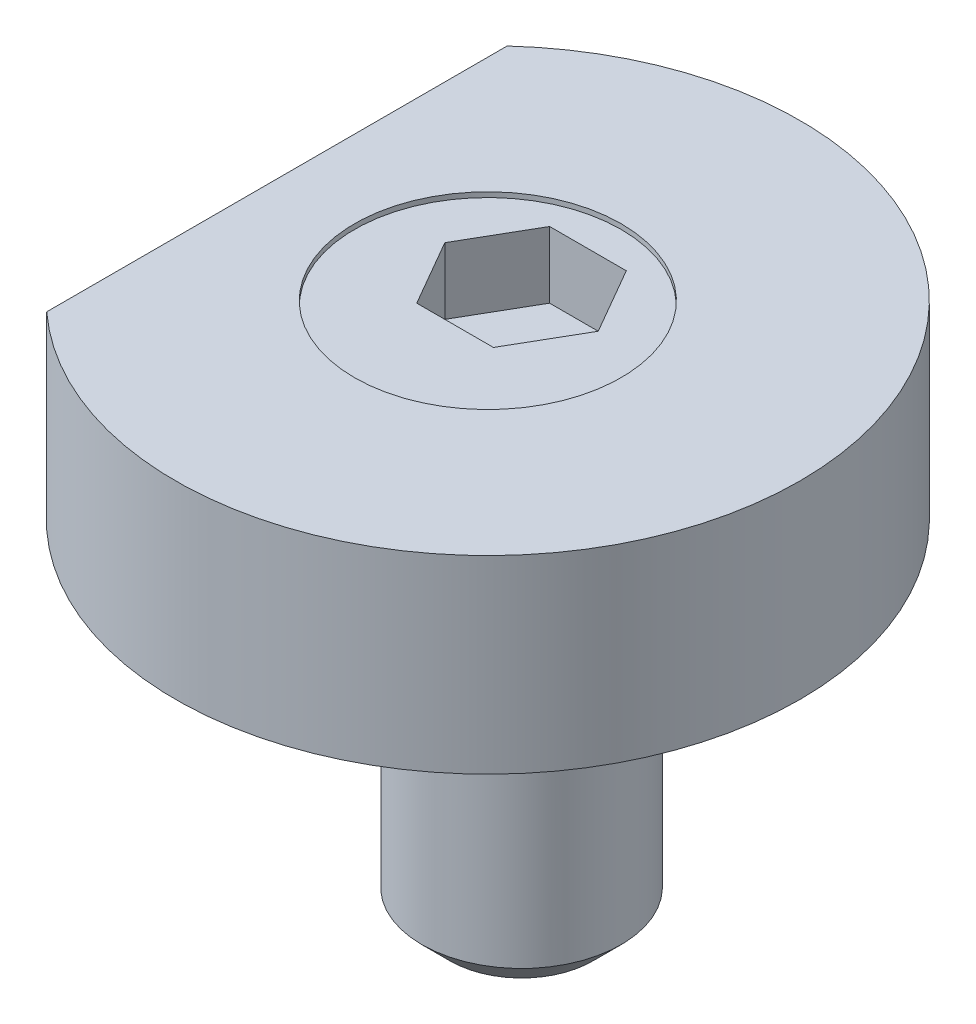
ISO-10303-21;
HEADER;
FILE_DESCRIPTION(('STEP AP214'),'2;1');
FILE_NAME('part.step','',(''),(''),'','','');
FILE_SCHEMA(('AUTOMOTIVE_DESIGN { 1 0 10303 214 1 1 1 1 }'));
ENDSEC;
DATA;
#1=APPLICATION_CONTEXT('core data for automotive mechanical design processes');
#2=APPLICATION_PROTOCOL_DEFINITION('international standard','automotive_design',2000,#1);
#3=PRODUCT_CONTEXT('',#1,'mechanical');
#4=PRODUCT('Part','Part','',(#3));
#5=PRODUCT_RELATED_PRODUCT_CATEGORY('part','',(#4));
#6=PRODUCT_DEFINITION_FORMATION('','',#4);
#7=PRODUCT_DEFINITION_CONTEXT('part definition',#1,'design');
#8=PRODUCT_DEFINITION('design','',#6,#7);
#9=PRODUCT_DEFINITION_SHAPE('','',#8);
#10=(LENGTH_UNIT() NAMED_UNIT(*) SI_UNIT(.MILLI.,.METRE.));
#11=(NAMED_UNIT(*) PLANE_ANGLE_UNIT() SI_UNIT($,.RADIAN.));
#12=(NAMED_UNIT(*) SI_UNIT($,.STERADIAN.) SOLID_ANGLE_UNIT());
#13=UNCERTAINTY_MEASURE_WITH_UNIT(LENGTH_MEASURE(1.E-05),#10,'distance_accuracy_value','');
#14=(GEOMETRIC_REPRESENTATION_CONTEXT(3) GLOBAL_UNCERTAINTY_ASSIGNED_CONTEXT((#13)) GLOBAL_UNIT_ASSIGNED_CONTEXT((#10,
#11,#12)) REPRESENTATION_CONTEXT('',''));
#15=CARTESIAN_POINT('',(0.,0.,0.));
#16=DIRECTION('',(0.,0.,1.));
#17=DIRECTION('',(1.,0.,0.));
#18=AXIS2_PLACEMENT_3D('',#15,#16,#17);
#19=CARTESIAN_POINT('',(0.,-21.9,-2.03));
#20=DIRECTION('',(0.,1.,0.));
#21=DIRECTION('',(0.,0.,1.));
#22=AXIS2_PLACEMENT_3D('',#19,#20,#21);
#23=CYLINDRICAL_SURFACE('',#22,6.);
#24=CARTESIAN_POINT('',(0.,-20.2,-2.03));
#25=DIRECTION('',(0.,1.,0.));
#26=DIRECTION('',(0.,0.,1.));
#27=AXIS2_PLACEMENT_3D('',#24,#25,#26);
#28=CIRCLE('',#27,6.);
#29=CARTESIAN_POINT('',(0.,-20.2,3.97));
#30=VERTEX_POINT('',#29);
#31=EDGE_CURVE('P0_E24',#30,#30,#28,.T.);
#32=ORIENTED_EDGE('',*,*,#31,.T.);
#33=EDGE_LOOP('',(#32));
#34=FACE_BOUND('',#33,.T.);
#35=CARTESIAN_POINT('',(0.,3.1,-2.03));
#36=DIRECTION('',(0.,1.,0.));
#37=DIRECTION('',(0.,0.,1.));
#38=AXIS2_PLACEMENT_3D('',#35,#36,#37);
#39=CIRCLE('',#38,6.);
#40=CARTESIAN_POINT('',(0.,3.1,-8.03));
#41=VERTEX_POINT('',#40);
#42=EDGE_CURVE('P0_E37',#41,#41,#39,.T.);
#43=ORIENTED_EDGE('',*,*,#42,.F.);
#44=EDGE_LOOP('',(#43));
#45=FACE_BOUND('',#44,.T.);
#46=ADVANCED_FACE('P0_F16',(#34,#45),#23,.T.);
#47=CARTESIAN_POINT('',(0.,-21.9,-2.03));
#48=DIRECTION('',(0.,1.,0.));
#49=DIRECTION('',(0.,0.,1.));
#50=AXIS2_PLACEMENT_3D('',#47,#48,#49);
#51=PLANE('',#50);
#52=CARTESIAN_POINT('',(0.,-21.9,-2.03));
#53=DIRECTION('',(0.,1.,0.));
#54=DIRECTION('',(0.,0.,1.));
#55=AXIS2_PLACEMENT_3D('',#52,#53,#54);
#56=CIRCLE('',#55,4.29999999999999);
#57=CARTESIAN_POINT('',(0.,-21.9,2.27));
#58=VERTEX_POINT('',#57);
#59=EDGE_CURVE('P0_E11',#58,#58,#56,.F.);
#60=ORIENTED_EDGE('',*,*,#59,.T.);
#61=EDGE_LOOP('',(#60));
#62=FACE_BOUND('',#61,.T.);
#63=ADVANCED_FACE('P0_F137',(#62),#51,.F.);
#64=CARTESIAN_POINT('',(0.,-20.2,-2.03));
#65=DIRECTION('',(0.,1.,0.));
#66=DIRECTION('',(0.,0.,1.));
#67=AXIS2_PLACEMENT_3D('',#64,#65,#66);
#68=CONICAL_SURFACE('',#67,6.,0.785398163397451);
#69=ORIENTED_EDGE('',*,*,#59,.F.);
#70=EDGE_LOOP('',(#69));
#71=FACE_BOUND('',#70,.T.);
#72=ORIENTED_EDGE('',*,*,#31,.F.);
#73=EDGE_LOOP('',(#72));
#74=FACE_BOUND('',#73,.T.);
#75=ADVANCED_FACE('P0_F18',(#71,#74),#68,.T.);
#76=CARTESIAN_POINT('',(0.,3.1,0.));
#77=DIRECTION('',(0.,1.,0.));
#78=DIRECTION('',(0.,0.,1.));
#79=AXIS2_PLACEMENT_3D('',#76,#77,#78);
#80=PLANE('',#79);
#81=CARTESIAN_POINT('',(0.,3.1,0.));
#82=DIRECTION('',(0.,1.,0.));
#83=DIRECTION('',(0.,0.,1.));
#84=AXIS2_PLACEMENT_3D('',#81,#82,#83);
#85=CIRCLE('',#84,8.03);
#86=EDGE_CURVE('P0_E118',#41,#41,#85,.T.);
#87=ORIENTED_EDGE('',*,*,#86,.F.);
#88=ORIENTED_EDGE('',*,*,#42,.T.);
#89=EDGE_LOOP('',(#87,#88));
#90=FACE_BOUND('',#89,.T.);
#91=ADVANCED_FACE('P0_F136',(#90),#80,.F.);
#92=CARTESIAN_POINT('',(0.,11.1,0.));
#93=DIRECTION('',(0.,-1.,0.));
#94=DIRECTION('',(0.,0.,-1.));
#95=AXIS2_PLACEMENT_3D('',#92,#93,#94);
#96=CYLINDRICAL_SURFACE('',#95,8.03);
#97=CARTESIAN_POINT('',(0.,11.1,0.));
#98=DIRECTION('',(0.,1.,0.));
#99=DIRECTION('',(0.,0.,1.));
#100=AXIS2_PLACEMENT_3D('',#97,#98,#99);
#101=CIRCLE('',#100,8.03);
#102=CARTESIAN_POINT('',(0.,11.1,8.03));
#103=VERTEX_POINT('',#102);
#104=EDGE_CURVE('P0_E126',#103,#103,#101,.T.);
#105=ORIENTED_EDGE('',*,*,#104,.F.);
#106=EDGE_LOOP('',(#105));
#107=FACE_BOUND('',#106,.T.);
#108=ORIENTED_EDGE('',*,*,#86,.T.);
#109=EDGE_LOOP('',(#108));
#110=FACE_BOUND('',#109,.T.);
#111=ADVANCED_FACE('P0_F144',(#107,#110),#96,.T.);
#112=CARTESIAN_POINT('',(0.,11.1,0.));
#113=DIRECTION('',(0.,1.,0.));
#114=DIRECTION('',(0.,0.,1.));
#115=AXIS2_PLACEMENT_3D('',#112,#113,#114);
#116=PLANE('',#115);
#117=DIRECTION('',(-0.5,0.,-0.866025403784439));
#118=VECTOR('',#117,1.);
#119=CARTESIAN_POINT('',(4.61880215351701,11.1,-2.03));
#120=LINE('',#119,#118);
#121=CARTESIAN_POINT('',(4.61880215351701,11.1,-2.03));
#122=VERTEX_POINT('',#121);
#123=CARTESIAN_POINT('',(2.3094010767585,11.1,-6.03));
#124=VERTEX_POINT('',#123);
#125=EDGE_CURVE('P0_E31',#122,#124,#120,.T.);
#126=ORIENTED_EDGE('',*,*,#125,.F.);
#127=DIRECTION('',(0.5,0.,-0.866025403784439));
#128=VECTOR('',#127,1.);
#129=CARTESIAN_POINT('',(2.3094010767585,11.1,1.97));
#130=LINE('',#129,#128);
#131=CARTESIAN_POINT('',(2.3094010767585,11.1,1.97));
#132=VERTEX_POINT('',#131);
#133=EDGE_CURVE('P0_E92',#132,#122,#130,.T.);
#134=ORIENTED_EDGE('',*,*,#133,.F.);
#135=DIRECTION('',(1.,0.,0.));
#136=VECTOR('',#135,1.);
#137=CARTESIAN_POINT('',(-2.3094010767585,11.1,1.97));
#138=LINE('',#137,#136);
#139=CARTESIAN_POINT('',(-2.3094010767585,11.1,1.97));
#140=VERTEX_POINT('',#139);
#141=EDGE_CURVE('P0_E95',#140,#132,#138,.T.);
#142=ORIENTED_EDGE('',*,*,#141,.F.);
#143=DIRECTION('',(0.5,0.,0.866025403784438));
#144=VECTOR('',#143,1.);
#145=CARTESIAN_POINT('',(-4.61880215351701,11.1,-2.03));
#146=LINE('',#145,#144);
#147=CARTESIAN_POINT('',(-4.61880215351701,11.1,-2.03));
#148=VERTEX_POINT('',#147);
#149=EDGE_CURVE('P0_E111',#148,#140,#146,.T.);
#150=ORIENTED_EDGE('',*,*,#149,.F.);
#151=DIRECTION('',(-0.5,0.,0.866025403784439));
#152=VECTOR('',#151,1.);
#153=CARTESIAN_POINT('',(-2.3094010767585,11.1,-6.03));
#154=LINE('',#153,#152);
#155=CARTESIAN_POINT('',(-2.3094010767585,11.1,-6.03));
#156=VERTEX_POINT('',#155);
#157=EDGE_CURVE('P0_E108',#156,#148,#154,.T.);
#158=ORIENTED_EDGE('',*,*,#157,.F.);
#159=DIRECTION('',(-1.,0.,0.));
#160=VECTOR('',#159,1.);
#161=CARTESIAN_POINT('',(2.3094010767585,11.1,-6.03));
#162=LINE('',#161,#160);
#163=EDGE_CURVE('P0_E106',#124,#156,#162,.T.);
#164=ORIENTED_EDGE('',*,*,#163,.F.);
#165=EDGE_LOOP('',(#126,#134,#142,#150,#158,#164));
#166=FACE_BOUND('',#165,.T.);
#167=ORIENTED_EDGE('',*,*,#104,.T.);
#168=EDGE_LOOP('',(#167));
#169=FACE_BOUND('',#168,.T.);
#170=ADVANCED_FACE('P0_F155',(#166,#169),#116,.T.);
#171=CARTESIAN_POINT('',(4.61880215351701,7.1,-2.03));
#172=DIRECTION('',(0.866025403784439,0.,-0.5));
#173=DIRECTION('',(-0.5,0.,-0.866025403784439));
#174=AXIS2_PLACEMENT_3D('',#171,#172,#173);
#175=PLANE('',#174);
#176=ORIENTED_EDGE('',*,*,#125,.T.);
#177=DIRECTION('',(0.,1.,0.));
#178=VECTOR('',#177,1.);
#179=CARTESIAN_POINT('',(2.3094010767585,7.1,-6.03));
#180=LINE('',#179,#178);
#181=CARTESIAN_POINT('',(2.3094010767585,7.1,-6.03));
#182=VERTEX_POINT('',#181);
#183=EDGE_CURVE('P0_E69',#182,#124,#180,.T.);
#184=ORIENTED_EDGE('',*,*,#183,.F.);
#185=DIRECTION('',(-0.5,0.,-0.866025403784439));
#186=VECTOR('',#185,1.);
#187=CARTESIAN_POINT('',(4.61880215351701,7.1,-2.03));
#188=LINE('',#187,#186);
#189=CARTESIAN_POINT('',(4.61880215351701,7.1,-2.03));
#190=VERTEX_POINT('',#189);
#191=EDGE_CURVE('P0_E73',#190,#182,#188,.T.);
#192=ORIENTED_EDGE('',*,*,#191,.F.);
#193=DIRECTION('',(0.,1.,0.));
#194=VECTOR('',#193,1.);
#195=CARTESIAN_POINT('',(4.61880215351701,7.1,-2.03));
#196=LINE('',#195,#194);
#197=EDGE_CURVE('P0_E116',#190,#122,#196,.T.);
#198=ORIENTED_EDGE('',*,*,#197,.T.);
#199=EDGE_LOOP('',(#176,#184,#192,#198));
#200=FACE_BOUND('',#199,.T.);
#201=ADVANCED_FACE('P0_F71',(#200),#175,.F.);
#202=CARTESIAN_POINT('',(2.3094010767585,7.1,1.97));
#203=DIRECTION('',(0.866025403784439,0.,0.5));
#204=DIRECTION('',(0.5,0.,-0.866025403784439));
#205=AXIS2_PLACEMENT_3D('',#202,#203,#204);
#206=PLANE('',#205);
#207=ORIENTED_EDGE('',*,*,#133,.T.);
#208=ORIENTED_EDGE('',*,*,#197,.F.);
#209=DIRECTION('',(0.5,0.,-0.866025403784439));
#210=VECTOR('',#209,1.);
#211=CARTESIAN_POINT('',(2.3094010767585,7.1,1.97));
#212=LINE('',#211,#210);
#213=CARTESIAN_POINT('',(2.3094010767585,7.1,1.97));
#214=VERTEX_POINT('',#213);
#215=EDGE_CURVE('P0_E79',#214,#190,#212,.T.);
#216=ORIENTED_EDGE('',*,*,#215,.F.);
#217=DIRECTION('',(0.,1.,0.));
#218=VECTOR('',#217,1.);
#219=CARTESIAN_POINT('',(2.3094010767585,7.1,1.97));
#220=LINE('',#219,#218);
#221=EDGE_CURVE('P0_E119',#214,#132,#220,.T.);
#222=ORIENTED_EDGE('',*,*,#221,.T.);
#223=EDGE_LOOP('',(#207,#208,#216,#222));
#224=FACE_BOUND('',#223,.T.);
#225=ADVANCED_FACE('P0_F163',(#224),#206,.F.);
#226=CARTESIAN_POINT('',(-2.3094010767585,7.1,1.97));
#227=DIRECTION('',(0.,0.,1.));
#228=DIRECTION('',(1.,0.,0.));
#229=AXIS2_PLACEMENT_3D('',#226,#227,#228);
#230=PLANE('',#229);
#231=ORIENTED_EDGE('',*,*,#141,.T.);
#232=ORIENTED_EDGE('',*,*,#221,.F.);
#233=DIRECTION('',(1.,0.,0.));
#234=VECTOR('',#233,1.);
#235=CARTESIAN_POINT('',(-2.3094010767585,7.1,1.97));
#236=LINE('',#235,#234);
#237=CARTESIAN_POINT('',(-2.3094010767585,7.1,1.97));
#238=VERTEX_POINT('',#237);
#239=EDGE_CURVE('P0_E102',#238,#214,#236,.T.);
#240=ORIENTED_EDGE('',*,*,#239,.F.);
#241=DIRECTION('',(0.,1.,0.));
#242=VECTOR('',#241,1.);
#243=CARTESIAN_POINT('',(-2.3094010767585,7.1,1.97));
#244=LINE('',#243,#242);
#245=EDGE_CURVE('P0_E121',#238,#140,#244,.T.);
#246=ORIENTED_EDGE('',*,*,#245,.T.);
#247=EDGE_LOOP('',(#231,#232,#240,#246));
#248=FACE_BOUND('',#247,.T.);
#249=ADVANCED_FACE('P0_F173',(#248),#230,.F.);
#250=CARTESIAN_POINT('',(-4.61880215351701,7.1,-2.03));
#251=DIRECTION('',(-0.866025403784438,0.,0.5));
#252=DIRECTION('',(0.5,0.,0.866025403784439));
#253=AXIS2_PLACEMENT_3D('',#250,#251,#252);
#254=PLANE('',#253);
#255=ORIENTED_EDGE('',*,*,#149,.T.);
#256=ORIENTED_EDGE('',*,*,#245,.F.);
#257=DIRECTION('',(0.5,0.,0.866025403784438));
#258=VECTOR('',#257,1.);
#259=CARTESIAN_POINT('',(-4.61880215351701,7.1,-2.03));
#260=LINE('',#259,#258);
#261=CARTESIAN_POINT('',(-4.61880215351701,7.1,-2.03));
#262=VERTEX_POINT('',#261);
#263=EDGE_CURVE('P0_E99',#262,#238,#260,.T.);
#264=ORIENTED_EDGE('',*,*,#263,.F.);
#265=DIRECTION('',(0.,1.,0.));
#266=VECTOR('',#265,1.);
#267=CARTESIAN_POINT('',(-4.61880215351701,7.1,-2.03));
#268=LINE('',#267,#266);
#269=EDGE_CURVE('P0_E123',#262,#148,#268,.T.);
#270=ORIENTED_EDGE('',*,*,#269,.T.);
#271=EDGE_LOOP('',(#255,#256,#264,#270));
#272=FACE_BOUND('',#271,.T.);
#273=ADVANCED_FACE('P0_F169',(#272),#254,.F.);
#274=CARTESIAN_POINT('',(-2.3094010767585,7.1,-6.03));
#275=DIRECTION('',(-0.866025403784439,0.,-0.5));
#276=DIRECTION('',(-0.5,0.,0.866025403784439));
#277=AXIS2_PLACEMENT_3D('',#274,#275,#276);
#278=PLANE('',#277);
#279=ORIENTED_EDGE('',*,*,#157,.T.);
#280=ORIENTED_EDGE('',*,*,#269,.F.);
#281=DIRECTION('',(-0.5,0.,0.866025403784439));
#282=VECTOR('',#281,1.);
#283=CARTESIAN_POINT('',(-2.3094010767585,7.1,-6.03));
#284=LINE('',#283,#282);
#285=CARTESIAN_POINT('',(-2.3094010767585,7.1,-6.03));
#286=VERTEX_POINT('',#285);
#287=EDGE_CURVE('P0_E87',#286,#262,#284,.T.);
#288=ORIENTED_EDGE('',*,*,#287,.F.);
#289=DIRECTION('',(0.,1.,0.));
#290=VECTOR('',#289,1.);
#291=CARTESIAN_POINT('',(-2.3094010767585,7.1,-6.03));
#292=LINE('',#291,#290);
#293=EDGE_CURVE('P0_E78',#286,#156,#292,.T.);
#294=ORIENTED_EDGE('',*,*,#293,.T.);
#295=EDGE_LOOP('',(#279,#280,#288,#294));
#296=FACE_BOUND('',#295,.T.);
#297=ADVANCED_FACE('P0_F166',(#296),#278,.F.);
#298=CARTESIAN_POINT('',(2.3094010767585,7.1,-6.03));
#299=DIRECTION('',(0.,0.,-1.));
#300=DIRECTION('',(-1.,0.,0.));
#301=AXIS2_PLACEMENT_3D('',#298,#299,#300);
#302=PLANE('',#301);
#303=ORIENTED_EDGE('',*,*,#163,.T.);
#304=ORIENTED_EDGE('',*,*,#293,.F.);
#305=DIRECTION('',(-1.,0.,0.));
#306=VECTOR('',#305,1.);
#307=CARTESIAN_POINT('',(2.3094010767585,7.1,-6.03));
#308=LINE('',#307,#306);
#309=EDGE_CURVE('P0_E82',#182,#286,#308,.T.);
#310=ORIENTED_EDGE('',*,*,#309,.F.);
#311=ORIENTED_EDGE('',*,*,#183,.T.);
#312=EDGE_LOOP('',(#303,#304,#310,#311));
#313=FACE_BOUND('',#312,.T.);
#314=ADVANCED_FACE('P0_F83',(#313),#302,.F.);
#315=CARTESIAN_POINT('',(2.3094010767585,7.1,-6.03));
#316=DIRECTION('',(0.,1.,0.));
#317=DIRECTION('',(0.,0.,1.));
#318=AXIS2_PLACEMENT_3D('',#315,#316,#317);
#319=PLANE('',#318);
#320=ORIENTED_EDGE('',*,*,#191,.T.);
#321=ORIENTED_EDGE('',*,*,#309,.T.);
#322=ORIENTED_EDGE('',*,*,#287,.T.);
#323=ORIENTED_EDGE('',*,*,#263,.T.);
#324=ORIENTED_EDGE('',*,*,#239,.T.);
#325=ORIENTED_EDGE('',*,*,#215,.T.);
#326=EDGE_LOOP('',(#320,#321,#322,#323,#324,#325));
#327=FACE_BOUND('',#326,.T.);
#328=ADVANCED_FACE('P0_F89',(#327),#319,.T.);
#329=CLOSED_SHELL('',(#46,#63,#75,#91,#111,#170,#201,#225,#249,#273,#297,#314,#328));
#330=MANIFOLD_SOLID_BREP('P0_B1',#329);
#331=CARTESIAN_POINT('',(0.,11.4,-2.03));
#332=DIRECTION('',(0.,-1.,0.));
#333=DIRECTION('',(0.,0.,-1.));
#334=AXIS2_PLACEMENT_3D('',#331,#332,#333);
#335=CYLINDRICAL_SURFACE('',#334,6.);
#336=CARTESIAN_POINT('',(0.,0.,-2.03));
#337=DIRECTION('',(0.,1.,0.));
#338=DIRECTION('',(0.,0.,1.));
#339=AXIS2_PLACEMENT_3D('',#336,#337,#338);
#340=CIRCLE('',#339,6.);
#341=CARTESIAN_POINT('',(0.,0.,3.97));
#342=VERTEX_POINT('',#341);
#343=EDGE_CURVE('P1_E61',#342,#342,#340,.T.);
#344=ORIENTED_EDGE('',*,*,#343,.F.);
#345=EDGE_LOOP('',(#344));
#346=FACE_BOUND('',#345,.T.);
#347=CARTESIAN_POINT('',(0.,3.1,-2.03));
#348=DIRECTION('',(0.,1.,0.));
#349=DIRECTION('',(0.,0.,1.));
#350=AXIS2_PLACEMENT_3D('',#347,#348,#349);
#351=CIRCLE('',#350,6.);
#352=CARTESIAN_POINT('',(0.,3.1,-8.03));
#353=VERTEX_POINT('',#352);
#354=EDGE_CURVE('P1_E10',#353,#353,#351,.T.);
#355=ORIENTED_EDGE('',*,*,#354,.T.);
#356=EDGE_LOOP('',(#355));
#357=FACE_BOUND('',#356,.T.);
#358=ADVANCED_FACE('P1_F15',(#346,#357),#335,.F.);
#359=CARTESIAN_POINT('',(0.,11.4,0.));
#360=DIRECTION('',(0.,1.,0.));
#361=DIRECTION('',(0.,0.,1.));
#362=AXIS2_PLACEMENT_3D('',#359,#360,#361);
#363=PLANE('',#362);
#364=CARTESIAN_POINT('',(0.,11.4,0.));
#365=DIRECTION('',(0.,1.,0.));
#366=DIRECTION('',(0.,0.,1.));
#367=AXIS2_PLACEMENT_3D('',#364,#365,#366);
#368=CIRCLE('',#367,8.03);
#369=CARTESIAN_POINT('',(0.,11.4,8.03));
#370=VERTEX_POINT('',#369);
#371=EDGE_CURVE('P1_E68',#370,#370,#368,.T.);
#372=ORIENTED_EDGE('',*,*,#371,.F.);
#373=EDGE_LOOP('',(#372));
#374=FACE_BOUND('',#373,.T.);
#375=CARTESIAN_POINT('',(0.,11.4,0.));
#376=DIRECTION('',(0.,1.,0.));
#377=DIRECTION('',(0.,0.,1.));
#378=AXIS2_PLACEMENT_3D('',#375,#376,#377);
#379=CIRCLE('',#378,18.8);
#380=CARTESIAN_POINT('',(-12.7,11.4,13.8618180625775));
#381=VERTEX_POINT('',#380);
#382=CARTESIAN_POINT('',(-12.7,11.4,-13.8618180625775));
#383=VERTEX_POINT('',#382);
#384=EDGE_CURVE('P1_E54',#381,#383,#379,.T.);
#385=ORIENTED_EDGE('',*,*,#384,.T.);
#386=DIRECTION('',(0.,0.,1.));
#387=VECTOR('',#386,1.);
#388=CARTESIAN_POINT('',(-12.7,11.4,-13.8618180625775));
#389=LINE('',#388,#387);
#390=EDGE_CURVE('P1_E35',#383,#381,#389,.T.);
#391=ORIENTED_EDGE('',*,*,#390,.T.);
#392=EDGE_LOOP('',(#385,#391));
#393=FACE_BOUND('',#392,.T.);
#394=ADVANCED_FACE('P1_F76',(#374,#393),#363,.T.);
#395=CARTESIAN_POINT('',(0.,0.,0.));
#396=DIRECTION('',(0.,1.,0.));
#397=DIRECTION('',(0.,0.,1.));
#398=AXIS2_PLACEMENT_3D('',#395,#396,#397);
#399=PLANE('',#398);
#400=CARTESIAN_POINT('',(0.,0.,0.));
#401=DIRECTION('',(0.,1.,0.));
#402=DIRECTION('',(0.,0.,1.));
#403=AXIS2_PLACEMENT_3D('',#400,#401,#402);
#404=CIRCLE('',#403,18.8);
#405=CARTESIAN_POINT('',(-12.7,0.,13.8618180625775));
#406=VERTEX_POINT('',#405);
#407=CARTESIAN_POINT('',(-12.7,0.,-13.8618180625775));
#408=VERTEX_POINT('',#407);
#409=EDGE_CURVE('P1_E55',#406,#408,#404,.T.);
#410=ORIENTED_EDGE('',*,*,#409,.F.);
#411=DIRECTION('',(0.,0.,1.));
#412=VECTOR('',#411,1.);
#413=CARTESIAN_POINT('',(-12.7,0.,-13.8618180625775));
#414=LINE('',#413,#412);
#415=EDGE_CURVE('P1_E45',#408,#406,#414,.T.);
#416=ORIENTED_EDGE('',*,*,#415,.F.);
#417=EDGE_LOOP('',(#410,#416));
#418=FACE_BOUND('',#417,.T.);
#419=ORIENTED_EDGE('',*,*,#343,.T.);
#420=EDGE_LOOP('',(#419));
#421=FACE_BOUND('',#420,.T.);
#422=ADVANCED_FACE('P1_F59',(#418,#421),#399,.F.);
#423=CARTESIAN_POINT('',(0.,11.4,0.));
#424=DIRECTION('',(0.,-1.,0.));
#425=DIRECTION('',(0.,0.,-1.));
#426=AXIS2_PLACEMENT_3D('',#423,#424,#425);
#427=CYLINDRICAL_SURFACE('',#426,18.8);
#428=ORIENTED_EDGE('',*,*,#409,.T.);
#429=DIRECTION('',(0.,-1.,0.));
#430=VECTOR('',#429,1.);
#431=CARTESIAN_POINT('',(-12.7,11.4,-13.8618180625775));
#432=LINE('',#431,#430);
#433=EDGE_CURVE('P1_E23',#383,#408,#432,.T.);
#434=ORIENTED_EDGE('',*,*,#433,.F.);
#435=ORIENTED_EDGE('',*,*,#384,.F.);
#436=DIRECTION('',(0.,-1.,0.));
#437=VECTOR('',#436,1.);
#438=CARTESIAN_POINT('',(-12.7,11.4,13.8618180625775));
#439=LINE('',#438,#437);
#440=EDGE_CURVE('P1_E48',#381,#406,#439,.T.);
#441=ORIENTED_EDGE('',*,*,#440,.T.);
#442=EDGE_LOOP('',(#428,#434,#435,#441));
#443=FACE_BOUND('',#442,.T.);
#444=ADVANCED_FACE('P1_F17',(#443),#427,.T.);
#445=CARTESIAN_POINT('',(-12.7,11.4,-13.8618180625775));
#446=DIRECTION('',(1.,0.,0.));
#447=DIRECTION('',(0.,0.,-1.));
#448=AXIS2_PLACEMENT_3D('',#445,#446,#447);
#449=PLANE('',#448);
#450=ORIENTED_EDGE('',*,*,#415,.T.);
#451=ORIENTED_EDGE('',*,*,#440,.F.);
#452=ORIENTED_EDGE('',*,*,#390,.F.);
#453=ORIENTED_EDGE('',*,*,#433,.T.);
#454=EDGE_LOOP('',(#450,#451,#452,#453));
#455=FACE_BOUND('',#454,.T.);
#456=ADVANCED_FACE('P1_F47',(#455),#449,.F.);
#457=CARTESIAN_POINT('',(0.,3.1,0.));
#458=DIRECTION('',(0.,1.,0.));
#459=DIRECTION('',(0.,0.,1.));
#460=AXIS2_PLACEMENT_3D('',#457,#458,#459);
#461=CYLINDRICAL_SURFACE('',#460,8.03);
#462=ORIENTED_EDGE('',*,*,#371,.T.);
#463=EDGE_LOOP('',(#462));
#464=FACE_BOUND('',#463,.T.);
#465=CARTESIAN_POINT('',(0.,3.1,0.));
#466=DIRECTION('',(0.,1.,0.));
#467=DIRECTION('',(0.,0.,1.));
#468=AXIS2_PLACEMENT_3D('',#465,#466,#467);
#469=CIRCLE('',#468,8.03);
#470=EDGE_CURVE('P1_E28',#353,#353,#469,.T.);
#471=ORIENTED_EDGE('',*,*,#470,.F.);
#472=EDGE_LOOP('',(#471));
#473=FACE_BOUND('',#472,.T.);
#474=ADVANCED_FACE('P1_F87',(#464,#473),#461,.F.);
#475=CARTESIAN_POINT('',(0.,3.1,0.));
#476=DIRECTION('',(0.,1.,0.));
#477=DIRECTION('',(0.,0.,1.));
#478=AXIS2_PLACEMENT_3D('',#475,#476,#477);
#479=PLANE('',#478);
#480=ORIENTED_EDGE('',*,*,#470,.T.);
#481=ORIENTED_EDGE('',*,*,#354,.F.);
#482=EDGE_LOOP('',(#480,#481));
#483=FACE_BOUND('',#482,.T.);
#484=ADVANCED_FACE('P1_F73',(#483),#479,.T.);
#485=CLOSED_SHELL('',(#358,#394,#422,#444,#456,#474,#484));
#486=MANIFOLD_SOLID_BREP('P1_B1',#485);
#487=ADVANCED_BREP_SHAPE_REPRESENTATION('',(#18,#330,#486),#14);
#488=SHAPE_DEFINITION_REPRESENTATION(#9,#487);
ENDSEC;
END-ISO-10303-21;
